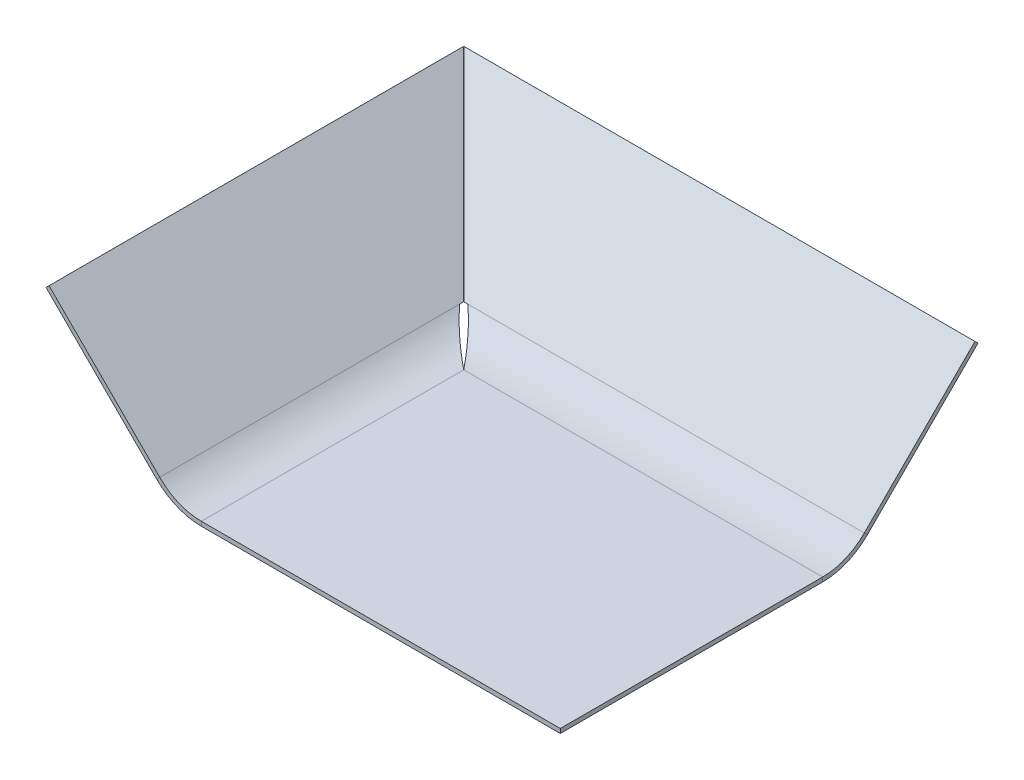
ISO-10303-21;
HEADER;
FILE_DESCRIPTION(('STEP AP214'),'2;1');
FILE_NAME('part.step','',(''),(''),'','','');
FILE_SCHEMA(('AUTOMOTIVE_DESIGN { 1 0 10303 214 1 1 1 1 }'));
ENDSEC;
DATA;
#1=APPLICATION_CONTEXT('core data for automotive mechanical design processes');
#2=APPLICATION_PROTOCOL_DEFINITION('international standard','automotive_design',2000,#1);
#3=PRODUCT_CONTEXT('',#1,'mechanical');
#4=PRODUCT('Part','Part','',(#3));
#5=PRODUCT_RELATED_PRODUCT_CATEGORY('part','',(#4));
#6=PRODUCT_DEFINITION_FORMATION('','',#4);
#7=PRODUCT_DEFINITION_CONTEXT('part definition',#1,'design');
#8=PRODUCT_DEFINITION('design','',#6,#7);
#9=PRODUCT_DEFINITION_SHAPE('','',#8);
#10=(LENGTH_UNIT() NAMED_UNIT(*) SI_UNIT(.MILLI.,.METRE.));
#11=(NAMED_UNIT(*) PLANE_ANGLE_UNIT() SI_UNIT($,.RADIAN.));
#12=(NAMED_UNIT(*) SI_UNIT($,.STERADIAN.) SOLID_ANGLE_UNIT());
#13=UNCERTAINTY_MEASURE_WITH_UNIT(LENGTH_MEASURE(1.E-05),#10,'distance_accuracy_value','');
#14=(GEOMETRIC_REPRESENTATION_CONTEXT(3) GLOBAL_UNCERTAINTY_ASSIGNED_CONTEXT((#13)) GLOBAL_UNIT_ASSIGNED_CONTEXT((#10,
#11,#12)) REPRESENTATION_CONTEXT('',''));
#15=CARTESIAN_POINT('',(0.,0.,0.));
#16=DIRECTION('',(0.,0.,1.));
#17=DIRECTION('',(1.,0.,0.));
#18=AXIS2_PLACEMENT_3D('',#15,#16,#17);
#19=CARTESIAN_POINT('',(60.9056458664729,-0.736599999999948,1.11022302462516E-13));
#20=DIRECTION('',(1.,0.,0.));
#21=DIRECTION('',(0.,0.,-1.));
#22=AXIS2_PLACEMENT_3D('',#19,#20,#21);
#23=PLANE('',#22);
#24=DIRECTION('',(0.,0.,-1.));
#25=VECTOR('',#24,1.);
#26=CARTESIAN_POINT('',(60.9056458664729,0.,1.09287578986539E-13));
#27=LINE('',#26,#25);
#28=CARTESIAN_POINT('',(60.9056458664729,0.,1.09287578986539E-13));
#29=VERTEX_POINT('',#28);
#30=CARTESIAN_POINT('',(60.9056458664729,0.,-44.5227980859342));
#31=VERTEX_POINT('',#30);
#32=EDGE_CURVE('E115',#29,#31,#27,.T.);
#33=ORIENTED_EDGE('',*,*,#32,.F.);
#34=DIRECTION('',(0.,1.,0.));
#35=VECTOR('',#34,1.);
#36=CARTESIAN_POINT('',(60.9056458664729,-0.736599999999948,1.11022302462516E-13));
#37=LINE('',#36,#35);
#38=CARTESIAN_POINT('',(60.9056458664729,-0.736599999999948,1.11022302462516E-13));
#39=VERTEX_POINT('',#38);
#40=EDGE_CURVE('E408',#39,#29,#37,.T.);
#41=ORIENTED_EDGE('',*,*,#40,.F.);
#42=DIRECTION('',(0.,0.,-1.));
#43=VECTOR('',#42,1.);
#44=CARTESIAN_POINT('',(60.9056458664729,-0.736599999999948,1.11022302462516E-13));
#45=LINE('',#44,#43);
#46=CARTESIAN_POINT('',(60.9056458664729,-0.736599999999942,-44.5227980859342));
#47=VERTEX_POINT('',#46);
#48=EDGE_CURVE('E411',#39,#47,#45,.T.);
#49=ORIENTED_EDGE('',*,*,#48,.T.);
#50=DIRECTION('',(0.,1.,0.));
#51=VECTOR('',#50,1.);
#52=CARTESIAN_POINT('',(60.9056458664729,-0.736599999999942,-44.5227980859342));
#53=LINE('',#52,#51);
#54=EDGE_CURVE('E399',#47,#31,#53,.T.);
#55=ORIENTED_EDGE('',*,*,#54,.T.);
#56=EDGE_LOOP('',(#33,#41,#49,#55));
#57=FACE_BOUND('',#56,.T.);
#58=ADVANCED_FACE('F88',(#57),#23,.T.);
#59=CARTESIAN_POINT('',(0.,-0.736599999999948,1.11022302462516E-13));
#60=DIRECTION('',(0.,0.,1.));
#61=DIRECTION('',(1.,0.,0.));
#62=AXIS2_PLACEMENT_3D('',#59,#60,#61);
#63=PLANE('',#62);
#64=DIRECTION('',(1.,0.,0.));
#65=VECTOR('',#64,1.);
#66=CARTESIAN_POINT('',(0.,0.,1.09287578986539E-13));
#67=LINE('',#66,#65);
#68=CARTESIAN_POINT('',(0.,0.,1.17961196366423E-13));
#69=VERTEX_POINT('',#68);
#70=EDGE_CURVE('E414',#69,#29,#67,.T.);
#71=ORIENTED_EDGE('',*,*,#70,.F.);
#72=DIRECTION('',(0.,1.,0.));
#73=VECTOR('',#72,1.);
#74=CARTESIAN_POINT('',(0.,-0.736599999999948,1.11022302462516E-13));
#75=LINE('',#74,#73);
#76=CARTESIAN_POINT('',(0.,-0.736599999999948,1.17961196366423E-13));
#77=VERTEX_POINT('',#76);
#78=EDGE_CURVE('E393',#77,#69,#75,.T.);
#79=ORIENTED_EDGE('',*,*,#78,.F.);
#80=DIRECTION('',(1.,0.,0.));
#81=VECTOR('',#80,1.);
#82=CARTESIAN_POINT('',(0.,-0.736599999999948,1.11022302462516E-13));
#83=LINE('',#82,#81);
#84=EDGE_CURVE('E413',#77,#39,#83,.T.);
#85=ORIENTED_EDGE('',*,*,#84,.T.);
#86=ORIENTED_EDGE('',*,*,#40,.T.);
#87=EDGE_LOOP('',(#71,#79,#85,#86));
#88=FACE_BOUND('',#87,.T.);
#89=ADVANCED_FACE('F90',(#88),#63,.T.);
#90=CARTESIAN_POINT('',(0.,-0.736599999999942,-44.5227980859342));
#91=DIRECTION('',(0.,-1.,0.));
#92=DIRECTION('',(0.,0.,-1.));
#93=AXIS2_PLACEMENT_3D('',#90,#91,#92);
#94=PLANE('',#93);
#95=DIRECTION('',(0.,0.,1.));
#96=VECTOR('',#95,1.);
#97=CARTESIAN_POINT('',(0.,-0.736599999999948,1.11022302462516E-13));
#98=LINE('',#97,#96);
#99=CARTESIAN_POINT('',(0.,-0.736599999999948,-44.5227980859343));
#100=VERTEX_POINT('',#99);
#101=EDGE_CURVE('E395',#100,#77,#98,.T.);
#102=ORIENTED_EDGE('',*,*,#101,.F.);
#103=DIRECTION('',(-1.,0.,0.));
#104=VECTOR('',#103,1.);
#105=CARTESIAN_POINT('',(0.,-0.736599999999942,-44.5227980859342));
#106=LINE('',#105,#104);
#107=EDGE_CURVE('E404',#47,#100,#106,.T.);
#108=ORIENTED_EDGE('',*,*,#107,.F.);
#109=ORIENTED_EDGE('',*,*,#48,.F.);
#110=ORIENTED_EDGE('',*,*,#84,.F.);
#111=EDGE_LOOP('',(#102,#108,#109,#110));
#112=FACE_BOUND('',#111,.T.);
#113=ADVANCED_FACE('F454',(#112),#94,.T.);
#114=CARTESIAN_POINT('',(0.,0.,-44.5227980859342));
#115=DIRECTION('',(0.,-1.,0.));
#116=DIRECTION('',(0.,0.,-1.));
#117=AXIS2_PLACEMENT_3D('',#114,#115,#116);
#118=PLANE('',#117);
#119=DIRECTION('',(0.,0.,1.));
#120=VECTOR('',#119,1.);
#121=CARTESIAN_POINT('',(0.,0.,1.09287578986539E-13));
#122=LINE('',#121,#120);
#123=CARTESIAN_POINT('',(0.,0.,-44.5227980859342));
#124=VERTEX_POINT('',#123);
#125=EDGE_CURVE('E99',#124,#69,#122,.T.);
#126=ORIENTED_EDGE('',*,*,#125,.T.);
#127=ORIENTED_EDGE('',*,*,#70,.T.);
#128=ORIENTED_EDGE('',*,*,#32,.T.);
#129=DIRECTION('',(-1.,0.,0.));
#130=VECTOR('',#129,1.);
#131=CARTESIAN_POINT('',(0.,0.,-44.5227980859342));
#132=LINE('',#131,#130);
#133=EDGE_CURVE('E402',#31,#124,#132,.T.);
#134=ORIENTED_EDGE('',*,*,#133,.T.);
#135=EDGE_LOOP('',(#126,#127,#128,#134));
#136=FACE_BOUND('',#135,.T.);
#137=ADVANCED_FACE('F457',(#136),#118,.F.);
#138=CARTESIAN_POINT('',(60.9056458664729,21.1837102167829,-70.8903536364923));
#139=DIRECTION('',(0.,-0.707106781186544,0.707106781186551));
#140=DIRECTION('',(0.,-0.707106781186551,-0.707106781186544));
#141=AXIS2_PLACEMENT_3D('',#138,#139,#140);
#142=PLANE('',#141);
#143=DIRECTION('',(-1.,0.,0.));
#144=VECTOR('',#143,1.);
#145=CARTESIAN_POINT('',(60.9056458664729,21.7045650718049,-70.3694987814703));
#146=LINE('',#145,#144);
#147=CARTESIAN_POINT('',(-25.7759900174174,21.7045650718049,-70.3694987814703));
#148=VERTEX_POINT('',#147);
#149=CARTESIAN_POINT('',(60.9056458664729,21.7045650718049,-70.3694987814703));
#150=VERTEX_POINT('',#149);
#151=EDGE_CURVE('E496',#148,#150,#146,.F.);
#152=ORIENTED_EDGE('',*,*,#151,.T.);
#153=DIRECTION('',(0.,0.707106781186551,0.707106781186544));
#154=VECTOR('',#153,1.);
#155=CARTESIAN_POINT('',(60.9056458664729,21.1837102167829,-70.8903536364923));
#156=LINE('',#155,#154);
#157=CARTESIAN_POINT('',(60.9056458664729,21.1837102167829,-70.8903536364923));
#158=VERTEX_POINT('',#157);
#159=EDGE_CURVE('E506',#158,#150,#156,.T.);
#160=ORIENTED_EDGE('',*,*,#159,.F.);
#161=DIRECTION('',(1.,0.,0.));
#162=VECTOR('',#161,1.);
#163=CARTESIAN_POINT('',(0.,21.1837102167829,-70.8903536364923));
#164=LINE('',#163,#162);
#165=CARTESIAN_POINT('',(-25.7759900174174,21.1837102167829,-70.8903536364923));
#166=VERTEX_POINT('',#165);
#167=EDGE_CURVE('E488',#166,#158,#164,.T.);
#168=ORIENTED_EDGE('',*,*,#167,.F.);
#169=DIRECTION('',(0.,0.707106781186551,0.707106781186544));
#170=VECTOR('',#169,1.);
#171=CARTESIAN_POINT('',(-25.7759900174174,21.1837102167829,-70.8903536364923));
#172=LINE('',#171,#170);
#173=EDGE_CURVE('E498',#166,#148,#172,.T.);
#174=ORIENTED_EDGE('',*,*,#173,.T.);
#175=EDGE_LOOP('',(#152,#160,#168,#174));
#176=FACE_BOUND('',#175,.T.);
#177=ADVANCED_FACE('F350',(#176),#142,.F.);
#178=CARTESIAN_POINT('',(-7.00035713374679,2.40807733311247,-52.1147207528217));
#179=DIRECTION('',(0.816496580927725,0.408248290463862,-0.408248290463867));
#180=DIRECTION('',(-0.447213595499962,0.,-0.894427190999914));
#181=AXIS2_PLACEMENT_3D('',#178,#179,#180);
#182=PLANE('',#181);
#183=DIRECTION('',(-0.577350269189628,0.577350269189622,-0.577350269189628));
#184=VECTOR('',#183,1.);
#185=CARTESIAN_POINT('',(-7.00035713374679,2.92893218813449,-51.5938658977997));
#186=LINE('',#185,#184);
#187=CARTESIAN_POINT('',(-7.00035713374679,2.92893218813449,-51.5938658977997));
#188=VERTEX_POINT('',#187);
#189=EDGE_CURVE('E490',#188,#148,#186,.T.);
#190=ORIENTED_EDGE('',*,*,#189,.T.);
#191=ORIENTED_EDGE('',*,*,#173,.F.);
#192=DIRECTION('',(-0.577350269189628,0.577350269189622,-0.577350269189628));
#193=VECTOR('',#192,1.);
#194=CARTESIAN_POINT('',(-7.00035713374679,2.40807733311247,-52.1147207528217));
#195=LINE('',#194,#193);
#196=CARTESIAN_POINT('',(-7.00035713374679,2.40807733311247,-52.1147207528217));
#197=VERTEX_POINT('',#196);
#198=EDGE_CURVE('E486',#197,#166,#195,.T.);
#199=ORIENTED_EDGE('',*,*,#198,.F.);
#200=DIRECTION('',(0.,0.707106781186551,0.707106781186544));
#201=VECTOR('',#200,1.);
#202=CARTESIAN_POINT('',(-7.00035713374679,2.40807733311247,-52.1147207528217));
#203=LINE('',#202,#201);
#204=EDGE_CURVE('E484',#197,#188,#203,.T.);
#205=ORIENTED_EDGE('',*,*,#204,.T.);
#206=EDGE_LOOP('',(#190,#191,#199,#205));
#207=FACE_BOUND('',#206,.T.);
#208=ADVANCED_FACE('F513',(#207),#182,.F.);
#209=CARTESIAN_POINT('',(0.,-0.52085485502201,-49.1857885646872));
#210=DIRECTION('',(0.,0.707106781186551,0.707106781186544));
#211=DIRECTION('',(0.,-0.707106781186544,0.707106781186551));
#212=AXIS2_PLACEMENT_3D('',#209,#210,#211);
#213=PLANE('',#212);
#214=DIRECTION('',(1.,0.,0.));
#215=VECTOR('',#214,1.);
#216=CARTESIAN_POINT('',(60.9056458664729,2.40807733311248,-52.1147207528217));
#217=LINE('',#216,#215);
#218=CARTESIAN_POINT('',(-6.36396103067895,2.40807733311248,-52.1147207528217));
#219=VERTEX_POINT('',#218);
#220=CARTESIAN_POINT('',(60.9056458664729,2.40807733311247,-52.1147207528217));
#221=VERTEX_POINT('',#220);
#222=EDGE_CURVE('E381',#219,#221,#217,.T.);
#223=ORIENTED_EDGE('',*,*,#222,.F.);
#224=DIRECTION('',(-1.,0.,0.));
#225=VECTOR('',#224,1.);
#226=CARTESIAN_POINT('',(-6.36396103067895,2.40807733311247,-52.1147207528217));
#227=LINE('',#226,#225);
#228=EDGE_CURVE('E479',#219,#197,#227,.T.);
#229=ORIENTED_EDGE('',*,*,#228,.T.);
#230=ORIENTED_EDGE('',*,*,#198,.T.);
#231=ORIENTED_EDGE('',*,*,#167,.T.);
#232=DIRECTION('',(0.,-0.707106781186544,0.707106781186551));
#233=VECTOR('',#232,1.);
#234=CARTESIAN_POINT('',(60.9056458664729,-0.52085485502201,-49.1857885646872));
#235=LINE('',#234,#233);
#236=EDGE_CURVE('E425',#158,#221,#235,.T.);
#237=ORIENTED_EDGE('',*,*,#236,.T.);
#238=EDGE_LOOP('',(#223,#229,#230,#231,#237));
#239=FACE_BOUND('',#238,.T.);
#240=ADVANCED_FACE('F446',(#239),#213,.F.);
#241=CARTESIAN_POINT('',(-6.36396103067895,2.40807733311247,-52.1147207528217));
#242=DIRECTION('',(0.,0.707106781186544,-0.707106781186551));
#243=DIRECTION('',(0.,0.707106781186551,0.707106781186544));
#244=AXIS2_PLACEMENT_3D('',#241,#242,#243);
#245=PLANE('',#244);
#246=DIRECTION('',(-1.,0.,0.));
#247=VECTOR('',#246,1.);
#248=CARTESIAN_POINT('',(-6.36396103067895,2.92893218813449,-51.5938658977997));
#249=LINE('',#248,#247);
#250=CARTESIAN_POINT('',(-6.36396103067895,2.92893218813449,-51.5938658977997));
#251=VERTEX_POINT('',#250);
#252=EDGE_CURVE('E422',#251,#188,#249,.T.);
#253=ORIENTED_EDGE('',*,*,#252,.T.);
#254=ORIENTED_EDGE('',*,*,#204,.F.);
#255=ORIENTED_EDGE('',*,*,#228,.F.);
#256=CARTESIAN_POINT('',(-6.36396103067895,2.92893218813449,-51.5938658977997));
#257=CARTESIAN_POINT('',(-6.36396103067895,2.40807733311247,-52.1147207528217));
#258=CARTESIAN_POINT('',(-6.36396103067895,2.40286878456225,-52.1199293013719));
#259=B_SPLINE_CURVE_WITH_KNOTS('',1,(#256,#257,#258),.UNSPECIFIED.,.F.,.F.,(2,1,2),(-0.01,0.99,
1.),.UNSPECIFIED.);
#260=EDGE_CURVE('E377',#251,#219,#259,.T.);
#261=ORIENTED_EDGE('',*,*,#260,.F.);
#262=EDGE_LOOP('',(#253,#254,#255,#261));
#263=FACE_BOUND('',#262,.T.);
#264=ADVANCED_FACE('F435',(#263),#245,.F.);
#265=CARTESIAN_POINT('',(0.,0.,-48.6649337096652));
#266=DIRECTION('',(0.,0.707106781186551,0.707106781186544));
#267=DIRECTION('',(0.,-0.707106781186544,0.707106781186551));
#268=AXIS2_PLACEMENT_3D('',#265,#266,#267);
#269=PLANE('',#268);
#270=ORIENTED_EDGE('',*,*,#151,.F.);
#271=ORIENTED_EDGE('',*,*,#189,.F.);
#272=ORIENTED_EDGE('',*,*,#252,.F.);
#273=DIRECTION('',(-1.,0.,0.));
#274=VECTOR('',#273,1.);
#275=CARTESIAN_POINT('',(60.9056458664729,2.92893218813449,-51.5938658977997));
#276=LINE('',#275,#274);
#277=CARTESIAN_POINT('',(60.9056458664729,2.92893218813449,-51.5938658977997));
#278=VERTEX_POINT('',#277);
#279=EDGE_CURVE('E383',#278,#251,#276,.T.);
#280=ORIENTED_EDGE('',*,*,#279,.F.);
#281=DIRECTION('',(0.,0.707106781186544,-0.707106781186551));
#282=VECTOR('',#281,1.);
#283=CARTESIAN_POINT('',(60.9056458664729,0.,-48.6649337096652));
#284=LINE('',#283,#282);
#285=EDGE_CURVE('E416',#150,#278,#284,.F.);
#286=ORIENTED_EDGE('',*,*,#285,.F.);
#287=EDGE_LOOP('',(#270,#271,#272,#280,#286));
#288=FACE_BOUND('',#287,.T.);
#289=ADVANCED_FACE('F445',(#288),#269,.T.);
#290=CARTESIAN_POINT('',(60.9056458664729,-0.520854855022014,-49.1857885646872));
#291=DIRECTION('',(-1.,0.,0.));
#292=DIRECTION('',(0.,0.,1.));
#293=AXIS2_PLACEMENT_3D('',#290,#291,#292);
#294=PLANE('',#293);
#295=DIRECTION('',(0.,-0.707106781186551,-0.707106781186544));
#296=VECTOR('',#295,1.);
#297=CARTESIAN_POINT('',(60.9056458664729,2.40807733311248,-52.1147207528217));
#298=LINE('',#297,#296);
#299=EDGE_CURVE('E424',#278,#221,#298,.T.);
#300=ORIENTED_EDGE('',*,*,#299,.T.);
#301=ORIENTED_EDGE('',*,*,#236,.F.);
#302=ORIENTED_EDGE('',*,*,#159,.T.);
#303=ORIENTED_EDGE('',*,*,#285,.T.);
#304=EDGE_LOOP('',(#300,#301,#302,#303));
#305=FACE_BOUND('',#304,.T.);
#306=ADVANCED_FACE('F342',(#305),#294,.F.);
#307=CARTESIAN_POINT('',(60.9056458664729,10.,-44.5227980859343));
#308=DIRECTION('',(1.,0.,0.));
#309=DIRECTION('',(0.,0.,-1.));
#310=AXIS2_PLACEMENT_3D('',#307,#308,#309);
#311=PLANE('',#310);
#312=ORIENTED_EDGE('',*,*,#299,.F.);
#313=CARTESIAN_POINT('',(60.9056458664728,10.,-44.5227980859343));
#314=DIRECTION('',(-1.,0.,0.));
#315=DIRECTION('',(0.,0.,1.));
#316=AXIS2_PLACEMENT_3D('',#313,#314,#315);
#317=CIRCLE('',#316,10.);
#318=EDGE_CURVE('E314',#278,#31,#317,.T.);
#319=ORIENTED_EDGE('',*,*,#318,.T.);
#320=ORIENTED_EDGE('',*,*,#54,.F.);
#321=CARTESIAN_POINT('',(60.9056458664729,10.,-44.5227980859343));
#322=DIRECTION('',(-1.,0.,0.));
#323=DIRECTION('',(0.,0.,1.));
#324=AXIS2_PLACEMENT_3D('',#321,#322,#323);
#325=CIRCLE('',#324,10.7366);
#326=EDGE_CURVE('E304',#221,#47,#325,.T.);
#327=ORIENTED_EDGE('',*,*,#326,.F.);
#328=EDGE_LOOP('',(#312,#319,#320,#327));
#329=FACE_BOUND('',#328,.T.);
#330=ADVANCED_FACE('F339',(#329),#311,.T.);
#331=CARTESIAN_POINT('',(0.,-0.743965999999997,-44.5227980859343));
#332=CARTESIAN_POINT('',(-0.53033392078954,-0.743965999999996,-45.2259941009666));
#333=CARTESIAN_POINT('',(-1.06066017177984,-0.674709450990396,-45.9291625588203));
#334=CARTESIAN_POINT('',(-2.12132034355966,-0.400337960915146,-47.308521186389));
#335=CARTESIAN_POINT('',(-2.65165042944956,-0.195229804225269,-47.9846721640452));
#336=CARTESIAN_POINT('',(-3.71231060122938,0.34296923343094,-49.283999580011));
#337=CARTESIAN_POINT('',(-4.24264068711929,0.676046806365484,-49.9071438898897));
#338=CARTESIAN_POINT('',(-5.30330085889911,1.45739070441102,-51.0765076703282));
#339=CARTESIAN_POINT('',(-5.83362710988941,1.90563411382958,-51.6226946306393));
#340=CARTESIAN_POINT('',(-6.36396103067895,2.40286878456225,-52.1199293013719));
#341=CARTESIAN_POINT('',(0.,-0.736599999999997,-44.5227980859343));
#342=CARTESIAN_POINT('',(-0.530333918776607,-0.736599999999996,-45.2255119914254));
#343=CARTESIAN_POINT('',(-1.06066017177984,-0.667390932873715,-45.928198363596));
#344=CARTESIAN_POINT('',(-2.12132034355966,-0.393207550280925,-47.3066113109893));
#345=CARTESIAN_POINT('',(-2.65165042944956,-0.18824001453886,-47.9822987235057));
#346=CARTESIAN_POINT('',(-3.71231060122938,0.349590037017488,-49.2807353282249));
#347=CARTESIAN_POINT('',(-4.24264068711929,0.682439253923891,-49.9034524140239));
#348=CARTESIAN_POINT('',(-5.30330085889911,1.46324746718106,-51.0720144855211));
#349=CARTESIAN_POINT('',(-5.83362711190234,1.91118356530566,-51.6178269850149));
#350=CARTESIAN_POINT('',(-6.36396103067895,2.40807733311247,-52.1147207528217));
#351=CARTESIAN_POINT('',(0.,0.,-44.5227980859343));
#352=CARTESIAN_POINT('',(-0.53033371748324,0.,-45.1773010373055));
#353=CARTESIAN_POINT('',(-1.06066017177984,0.0644608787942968,-45.8317788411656));
#354=CARTESIAN_POINT('',(-2.12132034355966,0.319833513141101,-47.1156237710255));
#355=CARTESIAN_POINT('',(-2.65165042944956,0.510738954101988,-47.7449546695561));
#356=CARTESIAN_POINT('',(-3.71231060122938,1.01167039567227,-48.9543101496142));
#357=CARTESIAN_POINT('',(-4.24264068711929,1.32168400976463,-49.5343048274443));
#358=CARTESIAN_POINT('',(-5.30330085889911,2.04892374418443,-50.6226960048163));
#359=CARTESIAN_POINT('',(-5.83362731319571,2.4661287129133,-51.1310624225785));
#360=CARTESIAN_POINT('',(-6.36396103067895,2.92893218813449,-51.5938658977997));
#361=B_SPLINE_SURFACE_WITH_KNOTS('',1,3,((#331,#332,#333,#334,#335,#336,#337,#338,#339,#340),
(#341,#342,#343,#344,#345,#346,#347,#348,#349,#350),(#351,#352,#353,#354,#355,#356,#357,#358,
#359,#360)),.UNSPECIFIED.,.F.,.F.,.F.,(2,1,2),(4,2,2,2,4),(-0.01,0.,1.),(0.,0.25,0.5,0.75,1.),.UNSPECIFIED.);
#362=CARTESIAN_POINT('',(0.,0.,-44.5227980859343));
#363=CARTESIAN_POINT('',(-0.132582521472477,-3.4708877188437E-06,-44.6864228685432));
#364=CARTESIAN_POINT('',(-0.265165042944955,0.00401582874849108,-44.8500473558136));
#365=CARTESIAN_POINT('',(-0.530330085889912,0.02007504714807,-45.1769023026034));
#366=CARTESIAN_POINT('',(-0.66291260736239,0.032114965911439,-45.3401327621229));
#367=CARTESIAN_POINT('',(-0.928077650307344,0.0641905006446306,-45.6658062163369));
#368=CARTESIAN_POINT('',(-1.06066017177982,0.0842261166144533,-45.8282492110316));
#369=CARTESIAN_POINT('',(-1.32582521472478,0.132243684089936,-46.1519564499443));
#370=CARTESIAN_POINT('',(-1.45840773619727,0.160225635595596,-46.3132206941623));
#371=CARTESIAN_POINT('',(-1.72357277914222,0.224068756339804,-46.6341819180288));
#372=CARTESIAN_POINT('',(-1.85615530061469,0.259929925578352,-46.7938788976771));
#373=CARTESIAN_POINT('',(-2.12132034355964,0.339445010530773,-47.1113208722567));
#374=CARTESIAN_POINT('',(-2.25390286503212,0.383098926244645,-47.2690658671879));
#375=CARTESIAN_POINT('',(-2.51906790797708,0.47809435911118,-47.5822238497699));
#376=CARTESIAN_POINT('',(-2.65165042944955,0.529435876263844,-47.7376368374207));
#377=CARTESIAN_POINT('',(-2.91681547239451,0.639682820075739,-48.0457564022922));
#378=CARTESIAN_POINT('',(-3.04939799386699,0.698588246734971,-48.1984629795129));
#379=CARTESIAN_POINT('',(-3.31456303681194,0.823821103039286,-48.5008018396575));
#380=CARTESIAN_POINT('',(-3.44714555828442,0.890148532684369,-48.6504341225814));
#381=CARTESIAN_POINT('',(-3.71231060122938,1.03006560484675,-48.9462639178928));
#382=CARTESIAN_POINT('',(-3.84489312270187,1.10365524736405,-49.0924614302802));
#383=CARTESIAN_POINT('',(-4.11005816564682,1.25791946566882,-49.3810694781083));
#384=CARTESIAN_POINT('',(-4.24264068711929,1.33859404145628,-49.523480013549));
#385=CARTESIAN_POINT('',(-4.50780573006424,1.50683375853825,-49.8041710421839));
#386=CARTESIAN_POINT('',(-4.64038825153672,1.59439889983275,-49.9424515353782));
#387=CARTESIAN_POINT('',(-4.90555329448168,1.77620885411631,-50.2145492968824));
#388=CARTESIAN_POINT('',(-5.03813581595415,1.87045366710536,-50.3483665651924));
#389=CARTESIAN_POINT('',(-5.30330085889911,2.06539570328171,-50.6112156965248));
#390=CARTESIAN_POINT('',(-5.4358833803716,2.16609292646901,-50.7402475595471));
#391=CARTESIAN_POINT('',(-5.70104842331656,2.3736980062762,-50.9932142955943));
#392=CARTESIAN_POINT('',(-5.83363094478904,2.4806058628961,-51.1171491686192));
#393=CARTESIAN_POINT('',(-6.09879598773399,2.70037163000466,-51.3596261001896));
#394=CARTESIAN_POINT('',(-6.23137850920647,2.81322954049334,-51.4781681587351));
#395=CARTESIAN_POINT('',(-6.36396103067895,2.92893218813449,-51.5938658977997));
#396=B_SPLINE_CURVE_WITH_KNOTS('',3,(#362,#363,#364,#365,#366,#367,#368,#369,#370,#371,#372,
#373,#374,#375,#376,#377,#378,#379,#380,#381,#382,#383,#384,#385,#386,#387,#388,#389,#390,#391,
#392,#393,#394,#395),.UNSPECIFIED.,.F.,.F.,(4,2,2,2,2,2,2,2,2,2,2,2,2,2,2,2,4),(0.,
0.631753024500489,1.26350604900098,1.89525907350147,2.52701209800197,3.15876512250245,
3.79051814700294,4.42227117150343,5.05402419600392,5.68577722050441,6.31753024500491,
6.94928326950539,7.58103629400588,8.21278931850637,8.84454234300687,9.47629536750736,
10.1080483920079),.UNSPECIFIED.);
#397=EDGE_CURVE('E313',#124,#251,#396,.T.);
#398=CARTESIAN_POINT('',(0.,-0.736599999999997,-44.5227980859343));
#399=CARTESIAN_POINT('',(-0.132582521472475,-0.736603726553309,-44.6984754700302));
#400=CARTESIAN_POINT('',(-0.265165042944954,-0.732288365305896,-44.8741525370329));
#401=CARTESIAN_POINT('',(-0.530330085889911,-0.715046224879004,-45.2250836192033));
#402=CARTESIAN_POINT('',(-0.66291260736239,-0.702119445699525,-45.4003376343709));
#403=CARTESIAN_POINT('',(-0.928077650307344,-0.667681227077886,-45.7500001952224));
#404=CARTESIAN_POINT('',(-1.06066017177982,-0.646169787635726,-45.9244087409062));
#405=CARTESIAN_POINT('',(-1.32582521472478,-0.59461524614,-46.2719602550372));
#406=CARTESIAN_POINT('',(-1.45840773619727,-0.564572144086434,-46.4451032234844));
#407=CARTESIAN_POINT('',(-1.72357277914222,-0.496026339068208,-46.7897064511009));
#408=CARTESIAN_POINT('',(-1.85615530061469,-0.457523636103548,-46.9611667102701));
#409=CARTESIAN_POINT('',(-2.12132034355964,-0.372151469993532,-47.3019914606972));
#410=CARTESIAN_POINT('',(-2.25390286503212,-0.325282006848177,-47.471355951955));
#411=CARTESIAN_POINT('',(-2.51906790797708,-0.223289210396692,-47.807581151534));
#412=CARTESIAN_POINT('',(-2.65165042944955,-0.168165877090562,-47.9744418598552));
#413=CARTESIAN_POINT('',(-2.91681547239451,-0.0497981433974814,-48.3052575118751));
#414=CARTESIAN_POINT('',(-3.04939799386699,0.0134462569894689,-48.4692124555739));
#415=CARTESIAN_POINT('',(-3.31456303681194,0.147903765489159,-48.7938215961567));
#416=CARTESIAN_POINT('',(-3.44714555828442,0.219116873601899,-48.9544757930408));
#417=CARTESIAN_POINT('',(-3.71231060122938,0.369340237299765,-49.2720964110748));
#418=CARTESIAN_POINT('',(-3.84489312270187,0.448350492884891,-49.4290628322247));
#419=CARTESIAN_POINT('',(-4.11005816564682,0.613977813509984,-49.7389297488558));
#420=CARTESIAN_POINT('',(-4.24264068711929,0.70059487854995,-49.8918302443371));
#421=CARTESIAN_POINT('',(-4.50780573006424,0.881227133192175,-50.1931969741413));
#422=CARTESIAN_POINT('',(-4.64038825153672,0.975242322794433,-50.3416632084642));
#423=CARTESIAN_POINT('',(-4.90555329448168,1.17044439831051,-50.6338036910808));
#424=CARTESIAN_POINT('',(-5.03813581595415,1.27163128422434,-50.7774779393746));
#425=CARTESIAN_POINT('',(-5.30330085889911,1.48093275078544,-51.0596885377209));
#426=CARTESIAN_POINT('',(-5.4358833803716,1.58904733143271,-51.1982248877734));
#427=CARTESIAN_POINT('',(-5.70104842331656,1.81194460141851,-51.4698251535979));
#428=CARTESIAN_POINT('',(-5.83363094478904,1.92672729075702,-51.6028890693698));
#429=CARTESIAN_POINT('',(-6.09879598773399,2.16268100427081,-51.8632268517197));
#430=CARTESIAN_POINT('',(-6.23137850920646,2.28385202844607,-51.9905007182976));
#431=CARTESIAN_POINT('',(-6.36396103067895,2.40807733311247,-52.1147207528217));
#432=B_SPLINE_CURVE_WITH_KNOTS('',3,(#398,#399,#400,#401,#402,#403,#404,#405,#406,#407,#408,
#409,#410,#411,#412,#413,#414,#415,#416,#417,#418,#419,#420,#421,#422,#423,#424,#425,#426,#427,
#428,#429,#430,#431),.UNSPECIFIED.,.F.,.F.,(4,2,2,2,2,2,2,2,2,2,2,2,2,2,2,2,4),(0.,
0.660234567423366,1.32046913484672,1.98070370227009,2.64093826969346,3.30117283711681,
3.96140740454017,4.62164197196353,5.28187653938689,5.94211110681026,6.60234567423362,
7.26258024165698,7.92281480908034,8.58304937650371,9.24328394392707,9.90351851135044,
10.5637530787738),.UNSPECIFIED.);
#433=EDGE_CURVE('E312',#100,#219,#432,.T.);
#434=CARTESIAN_POINT('',(0.,-0.743965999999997,-44.5227980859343));
#435=CARTESIAN_POINT('',(0.,-0.736599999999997,-44.5227980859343));
#436=CARTESIAN_POINT('',(0.,0.,-44.5227980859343));
#437=B_SPLINE_CURVE_WITH_KNOTS('',1,(#434,#435,#436),.UNSPECIFIED.,.F.,.F.,(2,1,2),(-0.01,0.,
1.),.UNSPECIFIED.);
#438=EDGE_CURVE('E13',#100,#124,#437,.T.);
#439=ORIENTED_EDGE('',*,*,#397,.T.);
#440=ORIENTED_EDGE('',*,*,#260,.T.);
#441=ORIENTED_EDGE('',*,*,#433,.F.);
#442=ORIENTED_EDGE('',*,*,#438,.T.);
#443=EDGE_LOOP('',(#439,#440,#441,#442));
#444=FACE_BOUND('',#443,.T.);
#445=ADVANCED_FACE('F333',(#444),#361,.T.);
#446=CARTESIAN_POINT('',(95.124004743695,10.,-44.5227980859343));
#447=DIRECTION('',(-1.,0.,0.));
#448=DIRECTION('',(0.,0.,1.));
#449=AXIS2_PLACEMENT_3D('',#446,#447,#448);
#450=CYLINDRICAL_SURFACE('',#449,10.7366);
#451=ORIENTED_EDGE('',*,*,#107,.T.);
#452=ORIENTED_EDGE('',*,*,#433,.T.);
#453=ORIENTED_EDGE('',*,*,#222,.T.);
#454=ORIENTED_EDGE('',*,*,#326,.T.);
#455=EDGE_LOOP('',(#451,#452,#453,#454));
#456=FACE_BOUND('',#455,.T.);
#457=ADVANCED_FACE('F325',(#456),#450,.T.);
#458=CARTESIAN_POINT('',(95.124004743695,10.,-44.5227980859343));
#459=DIRECTION('',(-1.,0.,0.));
#460=DIRECTION('',(0.,0.,1.));
#461=AXIS2_PLACEMENT_3D('',#458,#459,#460);
#462=CYLINDRICAL_SURFACE('',#461,10.);
#463=ORIENTED_EDGE('',*,*,#133,.F.);
#464=ORIENTED_EDGE('',*,*,#318,.F.);
#465=ORIENTED_EDGE('',*,*,#279,.T.);
#466=ORIENTED_EDGE('',*,*,#397,.F.);
#467=EDGE_LOOP('',(#463,#464,#465,#466));
#468=FACE_BOUND('',#467,.T.);
#469=ADVANCED_FACE('F277',(#468),#462,.F.);
#470=CARTESIAN_POINT('',(-7.59192266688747,2.40807733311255,-50.8867591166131));
#471=CARTESIAN_POINT('',(-7.09502889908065,1.91118356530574,-50.3564251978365));
#472=CARTESIAN_POINT('',(-6.54921639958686,1.46324746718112,-49.8260989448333));
#473=CARTESIAN_POINT('',(-5.38065432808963,0.682439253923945,-48.7654387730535));
#474=CARTESIAN_POINT('',(-4.7579372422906,0.349590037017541,-48.2351086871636));
#475=CARTESIAN_POINT('',(-3.45950063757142,-0.188240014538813,-47.1744485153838));
#476=CARTESIAN_POINT('',(-2.78381322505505,-0.39320755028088,-46.6441184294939));
#477=CARTESIAN_POINT('',(-1.40540027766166,-0.667390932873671,-45.5834582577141));
#478=CARTESIAN_POINT('',(-0.702713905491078,-0.736599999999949,-45.0531320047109));
#479=CARTESIAN_POINT('',(0.,-0.736599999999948,-44.5227980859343));
#480=CARTESIAN_POINT('',(-7.07106781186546,2.92893218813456,-50.8867591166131));
#481=CARTESIAN_POINT('',(-6.60826433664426,2.46612871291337,-50.3564253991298));
#482=CARTESIAN_POINT('',(-6.09989791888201,2.04892374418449,-49.8260989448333));
#483=CARTESIAN_POINT('',(-5.01150674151,1.32168400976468,-48.7654387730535));
#484=CARTESIAN_POINT('',(-4.43151206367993,1.01167039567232,-48.2351086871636));
#485=CARTESIAN_POINT('',(-3.22215658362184,0.510738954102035,-47.1744485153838));
#486=CARTESIAN_POINT('',(-2.59282568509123,0.319833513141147,-46.6441184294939));
#487=CARTESIAN_POINT('',(-1.30898075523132,0.0644608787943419,-45.5834582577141));
#488=CARTESIAN_POINT('',(-0.654502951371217,0.,-45.0531318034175));
#489=CARTESIAN_POINT('',(0.,0.,-44.5227980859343));
#490=B_SPLINE_SURFACE_WITH_KNOTS('',1,3,((#470,#471,#472,#473,#474,#475,#476,#477,#478,#479),
(#480,#481,#482,#483,#484,#485,#486,#487,#488,#489)),.UNSPECIFIED.,.F.,.F.,.F.,(2,2),(4,2,2,2,
4),(0.,1.),(0.,0.25,0.5,0.75,1.),.UNSPECIFIED.);
#491=CARTESIAN_POINT('',(-7.59192266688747,2.40807733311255,-50.8867591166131));
#492=CARTESIAN_POINT('',(-7.07106781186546,2.92893218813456,-50.8867591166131));
#493=B_SPLINE_CURVE_WITH_KNOTS('',1,(#491,#492),.UNSPECIFIED.,.F.,.F.,(2,2),(0.,1.),.UNSPECIFIED.);
#494=CARTESIAN_POINT('',(-7.07106781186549,2.92893218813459,-50.8867591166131));
#495=VERTEX_POINT('',#494);
#496=CARTESIAN_POINT('',(-7.59192266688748,2.40807733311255,-50.8867591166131));
#497=VERTEX_POINT('',#496);
#498=EDGE_CURVE('E215',#495,#497,#493,.F.);
#499=CARTESIAN_POINT('',(-7.07106781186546,2.92893218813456,-50.8867591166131));
#500=CARTESIAN_POINT('',(-6.60826433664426,2.46612871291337,-50.3564253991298));
#501=CARTESIAN_POINT('',(-6.09989791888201,2.04892374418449,-49.8260989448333));
#502=CARTESIAN_POINT('',(-5.01150674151,1.32168400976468,-48.7654387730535));
#503=CARTESIAN_POINT('',(-4.43151206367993,1.01167039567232,-48.2351086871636));
#504=CARTESIAN_POINT('',(-3.22215658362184,0.510738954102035,-47.1744485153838));
#505=CARTESIAN_POINT('',(-2.59282568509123,0.319833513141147,-46.6441184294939));
#506=CARTESIAN_POINT('',(-1.30898075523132,0.0644608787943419,-45.5834582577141));
#507=CARTESIAN_POINT('',(-0.654502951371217,0.,-45.0531318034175));
#508=CARTESIAN_POINT('',(0.,0.,-44.5227980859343));
#509=B_SPLINE_CURVE_WITH_KNOTS('',3,(#499,#500,#501,#502,#503,#504,#505,#506,#507,#508),
.UNSPECIFIED.,.F.,.F.,(4,2,2,2,4),(0.,0.25,0.5,0.75,1.),.UNSPECIFIED.);
#510=EDGE_CURVE('E106',#495,#124,#509,.T.);
#511=CARTESIAN_POINT('',(0.,-0.736599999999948,-44.5227980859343));
#512=CARTESIAN_POINT('',(-0.702713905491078,-0.736599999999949,-45.0531320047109));
#513=CARTESIAN_POINT('',(-1.40540027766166,-0.667390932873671,-45.5834582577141));
#514=CARTESIAN_POINT('',(-2.78381322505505,-0.39320755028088,-46.6441184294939));
#515=CARTESIAN_POINT('',(-3.45950063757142,-0.188240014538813,-47.1744485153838));
#516=CARTESIAN_POINT('',(-4.7579372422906,0.349590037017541,-48.2351086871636));
#517=CARTESIAN_POINT('',(-5.38065432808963,0.682439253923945,-48.7654387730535));
#518=CARTESIAN_POINT('',(-6.54921639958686,1.46324746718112,-49.8260989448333));
#519=CARTESIAN_POINT('',(-7.09502889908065,1.91118356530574,-50.3564251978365));
#520=CARTESIAN_POINT('',(-7.59192266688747,2.40807733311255,-50.8867591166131));
#521=B_SPLINE_CURVE_WITH_KNOTS('',3,(#511,#512,#513,#514,#515,#516,#517,#518,#519,#520),
.UNSPECIFIED.,.F.,.F.,(4,2,2,2,4),(0.,0.25,0.5,0.75,1.),.UNSPECIFIED.);
#522=EDGE_CURVE('E246',#497,#100,#521,.F.);
#523=ORIENTED_EDGE('',*,*,#498,.F.);
#524=ORIENTED_EDGE('',*,*,#510,.T.);
#525=ORIENTED_EDGE('',*,*,#438,.F.);
#526=ORIENTED_EDGE('',*,*,#522,.F.);
#527=EDGE_LOOP('',(#523,#524,#525,#526));
#528=FACE_BOUND('',#527,.T.);
#529=ADVANCED_FACE('F252',(#528),#490,.T.);
#530=CARTESIAN_POINT('',(0.,10.0000000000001,1.17961196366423E-13));
#531=DIRECTION('',(0.,0.,1.));
#532=DIRECTION('',(1.,0.,0.));
#533=AXIS2_PLACEMENT_3D('',#530,#531,#532);
#534=PLANE('',#533);
#535=CARTESIAN_POINT('',(0.,10.0000000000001,1.17961196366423E-13));
#536=DIRECTION('',(0.,0.,-1.));
#537=DIRECTION('',(-1.,0.,0.));
#538=AXIS2_PLACEMENT_3D('',#535,#536,#537);
#539=CIRCLE('',#538,10.);
#540=CARTESIAN_POINT('',(-7.07106781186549,2.92893218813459,1.07552855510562E-13));
#541=VERTEX_POINT('',#540);
#542=EDGE_CURVE('E255',#69,#541,#539,.T.);
#543=ORIENTED_EDGE('',*,*,#542,.T.);
#544=DIRECTION('',(-0.707106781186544,-0.707106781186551,0.));
#545=VECTOR('',#544,1.);
#546=CARTESIAN_POINT('',(-7.07106781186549,2.92893218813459,1.07552855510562E-13));
#547=LINE('',#546,#545);
#548=CARTESIAN_POINT('',(-7.5919226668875,2.40807733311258,1.09287578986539E-13));
#549=VERTEX_POINT('',#548);
#550=EDGE_CURVE('E231',#541,#549,#547,.T.);
#551=ORIENTED_EDGE('',*,*,#550,.T.);
#552=CARTESIAN_POINT('',(0.,10.0000000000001,1.17961196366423E-13));
#553=DIRECTION('',(0.,0.,-1.));
#554=DIRECTION('',(-1.,0.,0.));
#555=AXIS2_PLACEMENT_3D('',#552,#553,#554);
#556=CIRCLE('',#555,10.7366);
#557=EDGE_CURVE('E250',#77,#549,#556,.T.);
#558=ORIENTED_EDGE('',*,*,#557,.F.);
#559=ORIENTED_EDGE('',*,*,#78,.T.);
#560=EDGE_LOOP('',(#543,#551,#558,#559));
#561=FACE_BOUND('',#560,.T.);
#562=ADVANCED_FACE('F276',(#561),#534,.T.);
#563=CARTESIAN_POINT('',(0.,10.0000000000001,29.2780737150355));
#564=DIRECTION('',(0.,0.,-1.));
#565=DIRECTION('',(-1.,0.,0.));
#566=AXIS2_PLACEMENT_3D('',#563,#564,#565);
#567=CYLINDRICAL_SURFACE('',#566,10.7366);
#568=ORIENTED_EDGE('',*,*,#101,.T.);
#569=ORIENTED_EDGE('',*,*,#557,.T.);
#570=DIRECTION('',(0.,0.,-1.));
#571=VECTOR('',#570,1.);
#572=CARTESIAN_POINT('',(-7.5919226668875,2.40807733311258,-44.5227980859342));
#573=LINE('',#572,#571);
#574=EDGE_CURVE('E232',#549,#497,#573,.T.);
#575=ORIENTED_EDGE('',*,*,#574,.T.);
#576=ORIENTED_EDGE('',*,*,#522,.T.);
#577=EDGE_LOOP('',(#568,#569,#575,#576));
#578=FACE_BOUND('',#577,.T.);
#579=ADVANCED_FACE('F245',(#578),#567,.T.);
#580=CARTESIAN_POINT('',(0.,10.0000000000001,29.2780737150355));
#581=DIRECTION('',(0.,0.,-1.));
#582=DIRECTION('',(-1.,0.,0.));
#583=AXIS2_PLACEMENT_3D('',#580,#581,#582);
#584=CYLINDRICAL_SURFACE('',#583,10.);
#585=ORIENTED_EDGE('',*,*,#125,.F.);
#586=ORIENTED_EDGE('',*,*,#510,.F.);
#587=DIRECTION('',(0.,0.,1.));
#588=VECTOR('',#587,1.);
#589=CARTESIAN_POINT('',(-7.0710678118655,2.9289321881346,-44.5227980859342));
#590=LINE('',#589,#588);
#591=EDGE_CURVE('E219',#495,#541,#590,.T.);
#592=ORIENTED_EDGE('',*,*,#591,.T.);
#593=ORIENTED_EDGE('',*,*,#542,.F.);
#594=EDGE_LOOP('',(#585,#586,#592,#593));
#595=FACE_BOUND('',#594,.T.);
#596=ADVANCED_FACE('F278',(#595),#584,.F.);
#597=CARTESIAN_POINT('',(-7.59192266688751,2.40807733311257,-51.523155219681));
#598=DIRECTION('',(0.408248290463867,-0.408248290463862,-0.816496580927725));
#599=DIRECTION('',(-0.146446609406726,0.853553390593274,-0.5));
#600=AXIS2_PLACEMENT_3D('',#597,#598,#599);
#601=PLANE('',#600);
#602=DIRECTION('',(-0.577350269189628,0.577350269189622,-0.577350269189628));
#603=VECTOR('',#602,1.);
#604=CARTESIAN_POINT('',(-7.07106781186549,2.92893218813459,-51.523155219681));
#605=LINE('',#604,#603);
#606=CARTESIAN_POINT('',(-7.07106781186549,2.92893218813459,-51.523155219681));
#607=VERTEX_POINT('',#606);
#608=CARTESIAN_POINT('',(-25.8467006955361,21.704565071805,-70.2987881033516));
#609=VERTEX_POINT('',#608);
#610=EDGE_CURVE('E209',#607,#609,#605,.T.);
#611=ORIENTED_EDGE('',*,*,#610,.F.);
#612=DIRECTION('',(0.707106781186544,0.707106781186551,0.));
#613=VECTOR('',#612,1.);
#614=CARTESIAN_POINT('',(-7.59192266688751,2.40807733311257,-51.523155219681));
#615=LINE('',#614,#613);
#616=CARTESIAN_POINT('',(-7.59192266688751,2.40807733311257,-51.523155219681));
#617=VERTEX_POINT('',#616);
#618=EDGE_CURVE('E195',#617,#607,#615,.T.);
#619=ORIENTED_EDGE('',*,*,#618,.F.);
#620=DIRECTION('',(-0.577350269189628,0.577350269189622,-0.577350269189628));
#621=VECTOR('',#620,1.);
#622=CARTESIAN_POINT('',(-7.59192266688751,2.40807733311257,-51.523155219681));
#623=LINE('',#622,#621);
#624=CARTESIAN_POINT('',(-26.3675555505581,21.183710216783,-70.2987881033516));
#625=VERTEX_POINT('',#624);
#626=EDGE_CURVE('E240',#617,#625,#623,.T.);
#627=ORIENTED_EDGE('',*,*,#626,.T.);
#628=DIRECTION('',(0.707106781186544,0.707106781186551,0.));
#629=VECTOR('',#628,1.);
#630=CARTESIAN_POINT('',(-26.3675555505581,21.183710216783,-70.2987881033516));
#631=LINE('',#630,#629);
#632=EDGE_CURVE('E212',#625,#609,#631,.T.);
#633=ORIENTED_EDGE('',*,*,#632,.T.);
#634=EDGE_LOOP('',(#611,#619,#627,#633));
#635=FACE_BOUND('',#634,.T.);
#636=ADVANCED_FACE('F210',(#635),#601,.T.);
#637=CARTESIAN_POINT('',(-26.3675555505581,21.183710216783,-44.5227980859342));
#638=DIRECTION('',(0.707106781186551,-0.707106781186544,0.));
#639=DIRECTION('',(0.707106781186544,0.707106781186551,0.));
#640=AXIS2_PLACEMENT_3D('',#637,#638,#639);
#641=PLANE('',#640);
#642=DIRECTION('',(0.,0.,1.));
#643=VECTOR('',#642,1.);
#644=CARTESIAN_POINT('',(-25.8467006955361,21.704565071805,-44.5227980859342));
#645=LINE('',#644,#643);
#646=CARTESIAN_POINT('',(-25.8467006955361,21.704565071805,1.12757025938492E-13));
#647=VERTEX_POINT('',#646);
#648=EDGE_CURVE('E749',#647,#609,#645,.F.);
#649=ORIENTED_EDGE('',*,*,#648,.T.);
#650=ORIENTED_EDGE('',*,*,#632,.F.);
#651=DIRECTION('',(0.,0.,-1.));
#652=VECTOR('',#651,1.);
#653=CARTESIAN_POINT('',(-26.3675555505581,21.183710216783,-44.5227980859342));
#654=LINE('',#653,#652);
#655=CARTESIAN_POINT('',(-26.3675555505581,21.183710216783,1.12757025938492E-13));
#656=VERTEX_POINT('',#655);
#657=EDGE_CURVE('E222',#656,#625,#654,.T.);
#658=ORIENTED_EDGE('',*,*,#657,.F.);
#659=DIRECTION('',(0.707106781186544,0.707106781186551,0.));
#660=VECTOR('',#659,1.);
#661=CARTESIAN_POINT('',(-26.3675555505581,21.183710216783,1.12757025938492E-13));
#662=LINE('',#661,#660);
#663=EDGE_CURVE('E751',#656,#647,#662,.T.);
#664=ORIENTED_EDGE('',*,*,#663,.T.);
#665=EDGE_LOOP('',(#649,#650,#658,#664));
#666=FACE_BOUND('',#665,.T.);
#667=ADVANCED_FACE('F580',(#666),#641,.F.);
#668=CARTESIAN_POINT('',(-26.3675555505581,21.183710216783,-44.5227980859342));
#669=DIRECTION('',(0.707106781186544,0.707106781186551,0.));
#670=DIRECTION('',(-0.707106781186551,0.707106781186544,0.));
#671=AXIS2_PLACEMENT_3D('',#668,#669,#670);
#672=PLANE('',#671);
#673=ORIENTED_EDGE('',*,*,#574,.F.);
#674=DIRECTION('',(-0.707106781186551,0.707106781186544,0.));
#675=VECTOR('',#674,1.);
#676=CARTESIAN_POINT('',(-26.3675555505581,21.183710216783,1.12757025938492E-13));
#677=LINE('',#676,#675);
#678=EDGE_CURVE('E754',#549,#656,#677,.T.);
#679=ORIENTED_EDGE('',*,*,#678,.T.);
#680=ORIENTED_EDGE('',*,*,#657,.T.);
#681=ORIENTED_EDGE('',*,*,#626,.F.);
#682=DIRECTION('',(0.,0.,-1.));
#683=VECTOR('',#682,1.);
#684=CARTESIAN_POINT('',(-7.5919226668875,2.40807733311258,-50.8867591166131));
#685=LINE('',#684,#683);
#686=EDGE_CURVE('E202',#497,#617,#685,.T.);
#687=ORIENTED_EDGE('',*,*,#686,.F.);
#688=EDGE_LOOP('',(#673,#679,#680,#681,#687));
#689=FACE_BOUND('',#688,.T.);
#690=ADVANCED_FACE('F238',(#689),#672,.F.);
#691=CARTESIAN_POINT('',(-26.3675555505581,21.183710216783,1.12757025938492E-13));
#692=DIRECTION('',(0.,0.,-1.));
#693=DIRECTION('',(-1.,0.,0.));
#694=AXIS2_PLACEMENT_3D('',#691,#692,#693);
#695=PLANE('',#694);
#696=ORIENTED_EDGE('',*,*,#550,.F.);
#697=DIRECTION('',(0.707106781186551,-0.707106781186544,0.));
#698=VECTOR('',#697,1.);
#699=CARTESIAN_POINT('',(-25.8467006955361,21.704565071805,1.12757025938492E-13));
#700=LINE('',#699,#698);
#701=EDGE_CURVE('E220',#541,#647,#700,.F.);
#702=ORIENTED_EDGE('',*,*,#701,.T.);
#703=ORIENTED_EDGE('',*,*,#663,.F.);
#704=ORIENTED_EDGE('',*,*,#678,.F.);
#705=EDGE_LOOP('',(#696,#702,#703,#704));
#706=FACE_BOUND('',#705,.T.);
#707=ADVANCED_FACE('F594',(#706),#695,.F.);
#708=CARTESIAN_POINT('',(-25.8467006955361,21.704565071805,-44.5227980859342));
#709=DIRECTION('',(0.707106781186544,0.707106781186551,0.));
#710=DIRECTION('',(-0.707106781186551,0.707106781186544,0.));
#711=AXIS2_PLACEMENT_3D('',#708,#709,#710);
#712=PLANE('',#711);
#713=ORIENTED_EDGE('',*,*,#701,.F.);
#714=ORIENTED_EDGE('',*,*,#591,.F.);
#715=DIRECTION('',(0.,0.,-1.));
#716=VECTOR('',#715,1.);
#717=CARTESIAN_POINT('',(-7.07106781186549,2.92893218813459,-50.8867591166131));
#718=LINE('',#717,#716);
#719=EDGE_CURVE('E199',#495,#607,#718,.T.);
#720=ORIENTED_EDGE('',*,*,#719,.T.);
#721=ORIENTED_EDGE('',*,*,#610,.T.);
#722=ORIENTED_EDGE('',*,*,#648,.F.);
#723=EDGE_LOOP('',(#713,#714,#720,#721,#722));
#724=FACE_BOUND('',#723,.T.);
#725=ADVANCED_FACE('F217',(#724),#712,.T.);
#726=CARTESIAN_POINT('',(-7.5919226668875,2.40807733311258,-50.8867591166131));
#727=DIRECTION('',(0.707106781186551,-0.707106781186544,0.));
#728=DIRECTION('',(-0.499999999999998,-0.500000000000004,-0.707106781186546));
#729=AXIS2_PLACEMENT_3D('',#726,#727,#728);
#730=PLANE('',#729);
#731=ORIENTED_EDGE('',*,*,#719,.F.);
#732=ORIENTED_EDGE('',*,*,#498,.T.);
#733=ORIENTED_EDGE('',*,*,#686,.T.);
#734=ORIENTED_EDGE('',*,*,#618,.T.);
#735=EDGE_LOOP('',(#731,#732,#733,#734));
#736=FACE_BOUND('',#735,.T.);
#737=ADVANCED_FACE('F197',(#736),#730,.T.);
#738=CLOSED_SHELL('',(#58,#89,#113,#137,#177,#208,#240,#264,#289,#306,#330,#445,#457,#469,#529,
#562,#579,#596,#636,#667,#690,#707,#725,#737));
#739=MANIFOLD_SOLID_BREP('B2',#738);
#740=ADVANCED_BREP_SHAPE_REPRESENTATION('',(#18,#739),#14);
#741=SHAPE_DEFINITION_REPRESENTATION(#9,#740);
ENDSEC;
END-ISO-10303-21;
